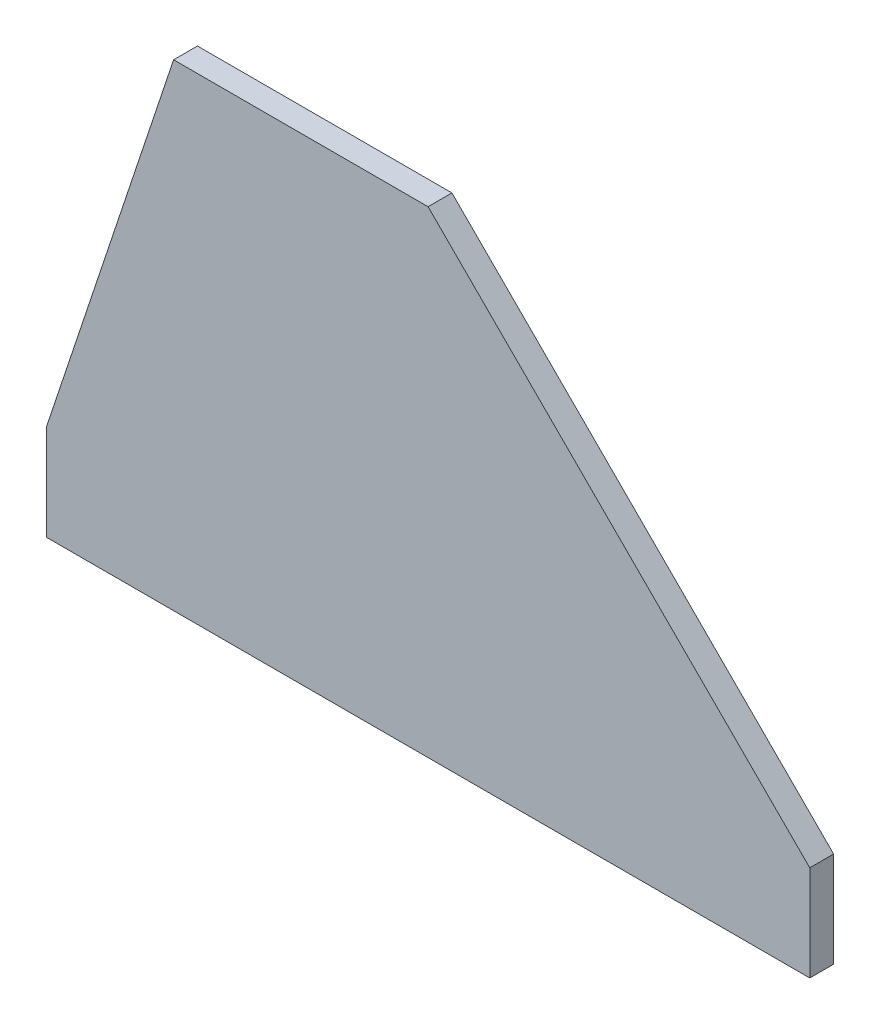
from build123d import *

# Parameters (mm, degrees)
EXTRUDE1_DEPTH = 4.7625


with BuildPart() as part:
    # Sketch1 → Extrude1 (new body)
    with BuildSketch(Plane.XY):
        Polygon((152.4, 0), (76.2, 76.2), (25.4, 76.2), (0, 0), (0, -19.05), (152.4, -19.05), align=None)
    extrude(amount=EXTRUDE1_DEPTH)


solid = part.part
